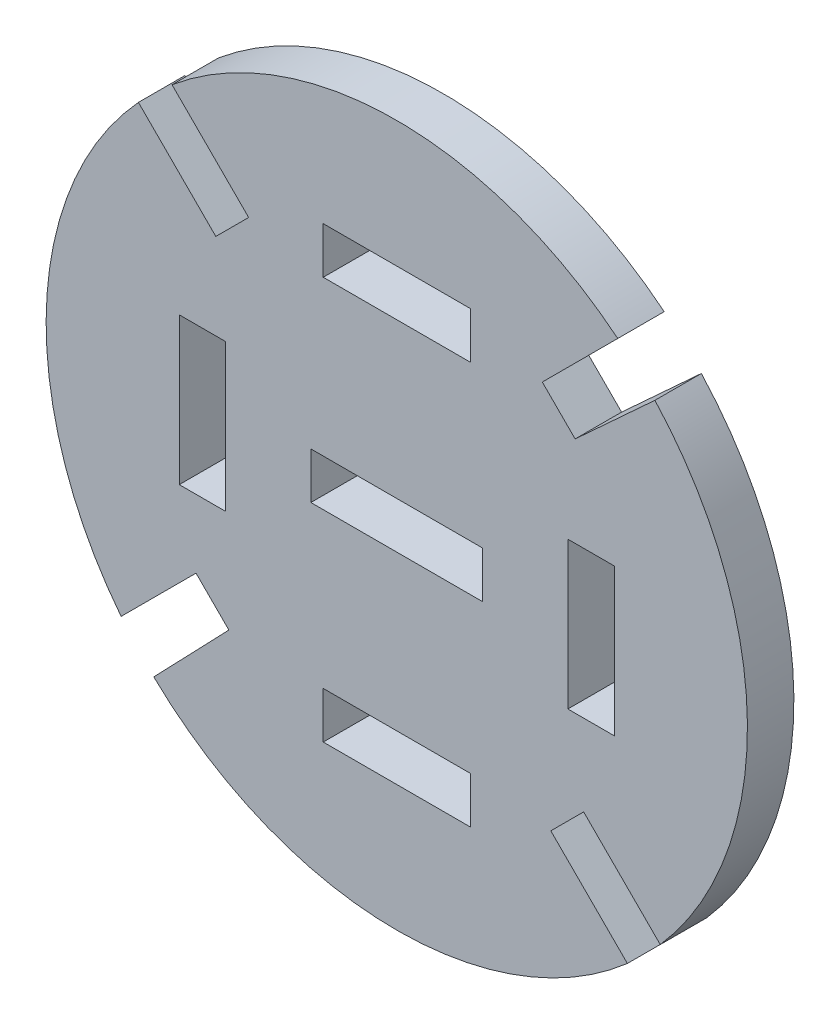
ISO-10303-21;
HEADER;
FILE_DESCRIPTION(('STEP AP214'),'2;1');
FILE_NAME('part.step','',(''),(''),'','','');
FILE_SCHEMA(('AUTOMOTIVE_DESIGN { 1 0 10303 214 1 1 1 1 }'));
ENDSEC;
DATA;
#1=APPLICATION_CONTEXT('core data for automotive mechanical design processes');
#2=APPLICATION_PROTOCOL_DEFINITION('international standard','automotive_design',2000,#1);
#3=PRODUCT_CONTEXT('',#1,'mechanical');
#4=PRODUCT('Part','Part','',(#3));
#5=PRODUCT_RELATED_PRODUCT_CATEGORY('part','',(#4));
#6=PRODUCT_DEFINITION_FORMATION('','',#4);
#7=PRODUCT_DEFINITION_CONTEXT('part definition',#1,'design');
#8=PRODUCT_DEFINITION('design','',#6,#7);
#9=PRODUCT_DEFINITION_SHAPE('','',#8);
#10=(LENGTH_UNIT() NAMED_UNIT(*) SI_UNIT(.MILLI.,.METRE.));
#11=(NAMED_UNIT(*) PLANE_ANGLE_UNIT() SI_UNIT($,.RADIAN.));
#12=(NAMED_UNIT(*) SI_UNIT($,.STERADIAN.) SOLID_ANGLE_UNIT());
#13=UNCERTAINTY_MEASURE_WITH_UNIT(LENGTH_MEASURE(1.E-05),#10,'distance_accuracy_value','');
#14=(GEOMETRIC_REPRESENTATION_CONTEXT(3) GLOBAL_UNCERTAINTY_ASSIGNED_CONTEXT((#13)) GLOBAL_UNIT_ASSIGNED_CONTEXT((#10,
#11,#12)) REPRESENTATION_CONTEXT('',''));
#15=CARTESIAN_POINT('',(0.,0.,0.));
#16=DIRECTION('',(0.,0.,1.));
#17=DIRECTION('',(1.,0.,0.));
#18=AXIS2_PLACEMENT_3D('',#15,#16,#17);
#19=CARTESIAN_POINT('',(0.,0.,3.));
#20=DIRECTION('',(0.,0.,1.));
#21=DIRECTION('',(1.,0.,0.));
#22=AXIS2_PLACEMENT_3D('',#19,#20,#21);
#23=PLANE('',#22);
#24=CARTESIAN_POINT('',(0.,0.,3.));
#25=DIRECTION('',(0.,0.,1.));
#26=DIRECTION('',(1.,0.,0.));
#27=AXIS2_PLACEMENT_3D('',#24,#25,#26);
#28=CIRCLE('',#27,22.65);
#29=CARTESIAN_POINT('',(14.2729923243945,17.5870460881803,3.));
#30=VERTEX_POINT('',#29);
#31=CARTESIAN_POINT('',(-14.5176838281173,17.385607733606,3.));
#32=VERTEX_POINT('',#31);
#33=EDGE_CURVE('E497',#30,#32,#28,.T.);
#34=ORIENTED_EDGE('',*,*,#33,.T.);
#35=DIRECTION('',(0.707106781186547,-0.707106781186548,0.));
#36=VECTOR('',#35,1.);
#37=CARTESIAN_POINT('',(-9.56793635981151,12.4358602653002,3.));
#38=LINE('',#37,#36);
#39=CARTESIAN_POINT('',(-9.56793635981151,12.4358602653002,3.));
#40=VERTEX_POINT('',#39);
#41=EDGE_CURVE('E501',#32,#40,#38,.T.);
#42=ORIENTED_EDGE('',*,*,#41,.T.);
#43=DIRECTION('',(-0.707106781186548,-0.707106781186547,0.));
#44=VECTOR('',#43,1.);
#45=CARTESIAN_POINT('',(-11.6892567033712,10.3145399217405,3.));
#46=LINE('',#45,#44);
#47=CARTESIAN_POINT('',(-11.6892567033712,10.3145399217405,3.));
#48=VERTEX_POINT('',#47);
#49=EDGE_CURVE('E505',#40,#48,#46,.T.);
#50=ORIENTED_EDGE('',*,*,#49,.T.);
#51=DIRECTION('',(-0.707106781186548,0.707106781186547,0.));
#52=VECTOR('',#51,1.);
#53=CARTESIAN_POINT('',(-11.6892567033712,10.3145399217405,3.));
#54=LINE('',#53,#52);
#55=CARTESIAN_POINT('',(-16.6885704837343,15.3138537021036,3.));
#56=VERTEX_POINT('',#55);
#57=EDGE_CURVE('E508',#48,#56,#54,.T.);
#58=ORIENTED_EDGE('',*,*,#57,.T.);
#59=CARTESIAN_POINT('',(0.,0.,3.));
#60=DIRECTION('',(0.,0.,1.));
#61=DIRECTION('',(1.,0.,0.));
#62=AXIS2_PLACEMENT_3D('',#59,#60,#61);
#63=CIRCLE('',#62,22.65);
#64=CARTESIAN_POINT('',(-17.8057155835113,-13.9992497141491,3.));
#65=VERTEX_POINT('',#64);
#66=EDGE_CURVE('E511',#56,#65,#63,.T.);
#67=ORIENTED_EDGE('',*,*,#66,.T.);
#68=DIRECTION('',(0.707106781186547,0.707106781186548,0.));
#69=VECTOR('',#68,1.);
#70=CARTESIAN_POINT('',(-12.9673048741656,-9.16083900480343,3.));
#71=LINE('',#70,#69);
#72=CARTESIAN_POINT('',(-12.9673048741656,-9.16083900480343,3.));
#73=VERTEX_POINT('',#72);
#74=EDGE_CURVE('E514',#65,#73,#71,.T.);
#75=ORIENTED_EDGE('',*,*,#74,.T.);
#76=DIRECTION('',(0.707106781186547,-0.707106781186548,0.));
#77=VECTOR('',#76,1.);
#78=CARTESIAN_POINT('',(-10.845984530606,-11.2821593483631,3.));
#79=LINE('',#78,#77);
#80=CARTESIAN_POINT('',(-10.845984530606,-11.2821593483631,3.));
#81=VERTEX_POINT('',#80);
#82=EDGE_CURVE('E517',#73,#81,#79,.T.);
#83=ORIENTED_EDGE('',*,*,#82,.T.);
#84=DIRECTION('',(-0.693034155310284,-0.720904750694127,0.));
#85=VECTOR('',#84,1.);
#86=CARTESIAN_POINT('',(-10.845984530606,-11.2821593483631,3.));
#87=LINE('',#86,#85);
#88=CARTESIAN_POINT('',(-15.6972236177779,-16.328492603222,3.));
#89=VERTEX_POINT('',#88);
#90=EDGE_CURVE('E520',#81,#89,#87,.T.);
#91=ORIENTED_EDGE('',*,*,#90,.T.);
#92=CARTESIAN_POINT('',(0.,0.,3.));
#93=DIRECTION('',(0.,0.,1.));
#94=DIRECTION('',(1.,0.,0.));
#95=AXIS2_PLACEMENT_3D('',#92,#93,#94);
#96=CIRCLE('',#95,22.65);
#97=CARTESIAN_POINT('',(14.8951464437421,-17.0633265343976,3.));
#98=VERTEX_POINT('',#97);
#99=EDGE_CURVE('E523',#89,#98,#96,.T.);
#100=ORIENTED_EDGE('',*,*,#99,.T.);
#101=DIRECTION('',(-0.707106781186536,0.707106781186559,0.));
#102=VECTOR('',#101,1.);
#103=CARTESIAN_POINT('',(9.94850910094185,-12.1166891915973,3.));
#104=LINE('',#103,#102);
#105=CARTESIAN_POINT('',(9.94850910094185,-12.1166891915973,3.));
#106=VERTEX_POINT('',#105);
#107=EDGE_CURVE('E526',#98,#106,#104,.T.);
#108=ORIENTED_EDGE('',*,*,#107,.T.);
#109=DIRECTION('',(0.707106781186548,0.707106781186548,0.));
#110=VECTOR('',#109,1.);
#111=CARTESIAN_POINT('',(9.94850910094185,-12.1166891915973,3.));
#112=LINE('',#111,#110);
#113=CARTESIAN_POINT('',(12.0698294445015,-9.99536884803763,3.));
#114=VERTEX_POINT('',#113);
#115=EDGE_CURVE('E529',#106,#114,#112,.T.);
#116=ORIENTED_EDGE('',*,*,#115,.T.);
#117=DIRECTION('',(0.707106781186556,-0.707106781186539,0.));
#118=VECTOR('',#117,1.);
#119=CARTESIAN_POINT('',(12.0698294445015,-9.99536884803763,3.));
#120=LINE('',#119,#118);
#121=CARTESIAN_POINT('',(17.0195769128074,-14.9451163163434,3.));
#122=VERTEX_POINT('',#121);
#123=EDGE_CURVE('E532',#114,#122,#120,.T.);
#124=ORIENTED_EDGE('',*,*,#123,.T.);
#125=CARTESIAN_POINT('',(0.,0.,3.));
#126=DIRECTION('',(0.,0.,1.));
#127=DIRECTION('',(1.,0.,0.));
#128=AXIS2_PLACEMENT_3D('',#125,#126,#127);
#129=CIRCLE('',#128,22.65);
#130=CARTESIAN_POINT('',(16.6738305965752,15.3299012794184,3.));
#131=VERTEX_POINT('',#130);
#132=EDGE_CURVE('E535',#122,#131,#129,.T.);
#133=ORIENTED_EDGE('',*,*,#132,.T.);
#134=DIRECTION('',(-0.736151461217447,-0.676816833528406,0.));
#135=VECTOR('',#134,1.);
#136=CARTESIAN_POINT('',(11.520770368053,10.5921834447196,3.));
#137=LINE('',#136,#135);
#138=CARTESIAN_POINT('',(11.520770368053,10.5921834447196,3.));
#139=VERTEX_POINT('',#138);
#140=EDGE_CURVE('E538',#131,#139,#137,.T.);
#141=ORIENTED_EDGE('',*,*,#140,.T.);
#142=DIRECTION('',(-0.707106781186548,0.707106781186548,0.));
#143=VECTOR('',#142,1.);
#144=CARTESIAN_POINT('',(9.3994500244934,12.7135037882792,3.));
#145=LINE('',#144,#143);
#146=CARTESIAN_POINT('',(9.3994500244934,12.7135037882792,3.));
#147=VERTEX_POINT('',#146);
#148=EDGE_CURVE('E541',#139,#147,#145,.T.);
#149=ORIENTED_EDGE('',*,*,#148,.T.);
#150=DIRECTION('',(0.707106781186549,0.707106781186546,0.));
#151=VECTOR('',#150,1.);
#152=CARTESIAN_POINT('',(9.3994500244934,12.7135037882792,3.));
#153=LINE('',#152,#151);
#154=EDGE_CURVE('E544',#147,#30,#153,.T.);
#155=ORIENTED_EDGE('',*,*,#154,.T.);
#156=EDGE_LOOP('',(#34,#42,#50,#58,#67,#75,#83,#91,#100,#108,#116,#124,#133,#141,#149,#155));
#157=FACE_BOUND('',#156,.T.);
#158=DIRECTION('',(-1.,0.,0.));
#159=VECTOR('',#158,1.);
#160=CARTESIAN_POINT('',(-5.55,1.5,3.));
#161=LINE('',#160,#159);
#162=CARTESIAN_POINT('',(5.55,1.5,3.));
#163=VERTEX_POINT('',#162);
#164=CARTESIAN_POINT('',(-5.55,1.5,3.));
#165=VERTEX_POINT('',#164);
#166=EDGE_CURVE('E457',#163,#165,#161,.T.);
#167=ORIENTED_EDGE('',*,*,#166,.F.);
#168=DIRECTION('',(0.,1.,0.));
#169=VECTOR('',#168,1.);
#170=CARTESIAN_POINT('',(5.55,1.5,3.));
#171=LINE('',#170,#169);
#172=CARTESIAN_POINT('',(5.55,-1.5,3.));
#173=VERTEX_POINT('',#172);
#174=EDGE_CURVE('E454',#173,#163,#171,.T.);
#175=ORIENTED_EDGE('',*,*,#174,.F.);
#176=DIRECTION('',(1.,0.,0.));
#177=VECTOR('',#176,1.);
#178=CARTESIAN_POINT('',(-5.55,-1.5,3.));
#179=LINE('',#178,#177);
#180=CARTESIAN_POINT('',(-5.55,-1.5,3.));
#181=VERTEX_POINT('',#180);
#182=EDGE_CURVE('E465',#181,#173,#179,.T.);
#183=ORIENTED_EDGE('',*,*,#182,.F.);
#184=DIRECTION('',(0.,-1.,0.));
#185=VECTOR('',#184,1.);
#186=CARTESIAN_POINT('',(-5.55,1.5,3.));
#187=LINE('',#186,#185);
#188=EDGE_CURVE('E461',#165,#181,#187,.T.);
#189=ORIENTED_EDGE('',*,*,#188,.F.);
#190=EDGE_LOOP('',(#167,#175,#183,#189));
#191=FACE_BOUND('',#190,.T.);
#192=DIRECTION('',(-1.,0.,0.));
#193=VECTOR('',#192,1.);
#194=CARTESIAN_POINT('',(-4.75,-11.5,3.));
#195=LINE('',#194,#193);
#196=CARTESIAN_POINT('',(4.75,-11.5,3.));
#197=VERTEX_POINT('',#196);
#198=CARTESIAN_POINT('',(-4.75,-11.5,3.));
#199=VERTEX_POINT('',#198);
#200=EDGE_CURVE('E414',#197,#199,#195,.T.);
#201=ORIENTED_EDGE('',*,*,#200,.F.);
#202=DIRECTION('',(0.,1.,0.));
#203=VECTOR('',#202,1.);
#204=CARTESIAN_POINT('',(4.75,-11.5,3.));
#205=LINE('',#204,#203);
#206=CARTESIAN_POINT('',(4.75,-14.5,3.));
#207=VERTEX_POINT('',#206);
#208=EDGE_CURVE('E411',#207,#197,#205,.T.);
#209=ORIENTED_EDGE('',*,*,#208,.F.);
#210=DIRECTION('',(1.,0.,0.));
#211=VECTOR('',#210,1.);
#212=CARTESIAN_POINT('',(-4.75,-14.5,3.));
#213=LINE('',#212,#211);
#214=CARTESIAN_POINT('',(-4.75,-14.5,3.));
#215=VERTEX_POINT('',#214);
#216=EDGE_CURVE('E422',#215,#207,#213,.T.);
#217=ORIENTED_EDGE('',*,*,#216,.F.);
#218=DIRECTION('',(0.,-1.,0.));
#219=VECTOR('',#218,1.);
#220=CARTESIAN_POINT('',(-4.75,-11.5,3.));
#221=LINE('',#220,#219);
#222=EDGE_CURVE('E418',#199,#215,#221,.T.);
#223=ORIENTED_EDGE('',*,*,#222,.F.);
#224=EDGE_LOOP('',(#201,#209,#217,#223));
#225=FACE_BOUND('',#224,.T.);
#226=DIRECTION('',(1.,0.,0.));
#227=VECTOR('',#226,1.);
#228=CARTESIAN_POINT('',(11.05,-4.75,3.));
#229=LINE('',#228,#227);
#230=CARTESIAN_POINT('',(11.05,-4.75,3.));
#231=VERTEX_POINT('',#230);
#232=CARTESIAN_POINT('',(14.05,-4.75,3.));
#233=VERTEX_POINT('',#232);
#234=EDGE_CURVE('E371',#231,#233,#229,.T.);
#235=ORIENTED_EDGE('',*,*,#234,.F.);
#236=DIRECTION('',(0.,-1.,0.));
#237=VECTOR('',#236,1.);
#238=CARTESIAN_POINT('',(11.05,4.75,3.));
#239=LINE('',#238,#237);
#240=CARTESIAN_POINT('',(11.05,4.75,3.));
#241=VERTEX_POINT('',#240);
#242=EDGE_CURVE('E368',#241,#231,#239,.T.);
#243=ORIENTED_EDGE('',*,*,#242,.F.);
#244=DIRECTION('',(-1.,0.,0.));
#245=VECTOR('',#244,1.);
#246=CARTESIAN_POINT('',(11.05,4.75,3.));
#247=LINE('',#246,#245);
#248=CARTESIAN_POINT('',(14.05,4.75,3.));
#249=VERTEX_POINT('',#248);
#250=EDGE_CURVE('E379',#249,#241,#247,.T.);
#251=ORIENTED_EDGE('',*,*,#250,.F.);
#252=DIRECTION('',(0.,1.,0.));
#253=VECTOR('',#252,1.);
#254=CARTESIAN_POINT('',(14.05,4.75,3.));
#255=LINE('',#254,#253);
#256=EDGE_CURVE('E375',#233,#249,#255,.T.);
#257=ORIENTED_EDGE('',*,*,#256,.F.);
#258=EDGE_LOOP('',(#235,#243,#251,#257));
#259=FACE_BOUND('',#258,.T.);
#260=DIRECTION('',(-1.,0.,0.));
#261=VECTOR('',#260,1.);
#262=CARTESIAN_POINT('',(-4.75,14.5,3.));
#263=LINE('',#262,#261);
#264=CARTESIAN_POINT('',(4.75,14.5,3.));
#265=VERTEX_POINT('',#264);
#266=CARTESIAN_POINT('',(-4.75,14.5,3.));
#267=VERTEX_POINT('',#266);
#268=EDGE_CURVE('E328',#265,#267,#263,.T.);
#269=ORIENTED_EDGE('',*,*,#268,.F.);
#270=DIRECTION('',(0.,1.,0.));
#271=VECTOR('',#270,1.);
#272=CARTESIAN_POINT('',(4.75,11.5,3.));
#273=LINE('',#272,#271);
#274=CARTESIAN_POINT('',(4.75,11.5,3.));
#275=VERTEX_POINT('',#274);
#276=EDGE_CURVE('E325',#275,#265,#273,.T.);
#277=ORIENTED_EDGE('',*,*,#276,.F.);
#278=DIRECTION('',(1.,0.,0.));
#279=VECTOR('',#278,1.);
#280=CARTESIAN_POINT('',(-4.75,11.5,3.));
#281=LINE('',#280,#279);
#282=CARTESIAN_POINT('',(-4.75,11.5,3.));
#283=VERTEX_POINT('',#282);
#284=EDGE_CURVE('E336',#283,#275,#281,.T.);
#285=ORIENTED_EDGE('',*,*,#284,.F.);
#286=DIRECTION('',(0.,-1.,0.));
#287=VECTOR('',#286,1.);
#288=CARTESIAN_POINT('',(-4.75,11.5,3.));
#289=LINE('',#288,#287);
#290=EDGE_CURVE('E332',#267,#283,#289,.T.);
#291=ORIENTED_EDGE('',*,*,#290,.F.);
#292=EDGE_LOOP('',(#269,#277,#285,#291));
#293=FACE_BOUND('',#292,.T.);
#294=DIRECTION('',(-1.,0.,0.));
#295=VECTOR('',#294,1.);
#296=CARTESIAN_POINT('',(-14.05,4.75,3.));
#297=LINE('',#296,#295);
#298=CARTESIAN_POINT('',(-11.05,4.75,3.));
#299=VERTEX_POINT('',#298);
#300=CARTESIAN_POINT('',(-14.05,4.75,3.));
#301=VERTEX_POINT('',#300);
#302=EDGE_CURVE('E286',#299,#301,#297,.T.);
#303=ORIENTED_EDGE('',*,*,#302,.F.);
#304=DIRECTION('',(0.,1.,0.));
#305=VECTOR('',#304,1.);
#306=CARTESIAN_POINT('',(-11.05,-4.75,3.));
#307=LINE('',#306,#305);
#308=CARTESIAN_POINT('',(-11.05,-4.75,3.));
#309=VERTEX_POINT('',#308);
#310=EDGE_CURVE('E277',#309,#299,#307,.T.);
#311=ORIENTED_EDGE('',*,*,#310,.F.);
#312=DIRECTION('',(1.,0.,0.));
#313=VECTOR('',#312,1.);
#314=CARTESIAN_POINT('',(-14.05,-4.75,3.));
#315=LINE('',#314,#313);
#316=CARTESIAN_POINT('',(-14.05,-4.75,3.));
#317=VERTEX_POINT('',#316);
#318=EDGE_CURVE('E303',#317,#309,#315,.T.);
#319=ORIENTED_EDGE('',*,*,#318,.F.);
#320=DIRECTION('',(0.,-1.,0.));
#321=VECTOR('',#320,1.);
#322=CARTESIAN_POINT('',(-14.05,-4.75,3.));
#323=LINE('',#322,#321);
#324=EDGE_CURVE('E299',#301,#317,#323,.T.);
#325=ORIENTED_EDGE('',*,*,#324,.F.);
#326=EDGE_LOOP('',(#303,#311,#319,#325));
#327=FACE_BOUND('',#326,.T.);
#328=ADVANCED_FACE('F43',(#157,#191,#225,#259,#293,#327),#23,.T.);
#329=CARTESIAN_POINT('',(0.,0.,0.));
#330=DIRECTION('',(0.,0.,1.));
#331=DIRECTION('',(1.,0.,0.));
#332=AXIS2_PLACEMENT_3D('',#329,#330,#331);
#333=PLANE('',#332);
#334=DIRECTION('',(0.,1.,0.));
#335=VECTOR('',#334,1.);
#336=CARTESIAN_POINT('',(4.75,11.5,0.));
#337=LINE('',#336,#335);
#338=CARTESIAN_POINT('',(4.75,11.5,0.));
#339=VERTEX_POINT('',#338);
#340=CARTESIAN_POINT('',(4.75,14.5,0.));
#341=VERTEX_POINT('',#340);
#342=EDGE_CURVE('E295',#339,#341,#337,.T.);
#343=ORIENTED_EDGE('',*,*,#342,.T.);
#344=DIRECTION('',(-1.,0.,0.));
#345=VECTOR('',#344,1.);
#346=CARTESIAN_POINT('',(-4.75,14.5,0.));
#347=LINE('',#346,#345);
#348=CARTESIAN_POINT('',(-4.75,14.5,0.));
#349=VERTEX_POINT('',#348);
#350=EDGE_CURVE('E343',#341,#349,#347,.T.);
#351=ORIENTED_EDGE('',*,*,#350,.T.);
#352=DIRECTION('',(0.,-1.,0.));
#353=VECTOR('',#352,1.);
#354=CARTESIAN_POINT('',(-4.75,11.5,0.));
#355=LINE('',#354,#353);
#356=CARTESIAN_POINT('',(-4.75,11.5,0.));
#357=VERTEX_POINT('',#356);
#358=EDGE_CURVE('E347',#349,#357,#355,.T.);
#359=ORIENTED_EDGE('',*,*,#358,.T.);
#360=DIRECTION('',(1.,0.,0.));
#361=VECTOR('',#360,1.);
#362=CARTESIAN_POINT('',(-4.75,11.5,0.));
#363=LINE('',#362,#361);
#364=EDGE_CURVE('E329',#357,#339,#363,.T.);
#365=ORIENTED_EDGE('',*,*,#364,.T.);
#366=EDGE_LOOP('',(#343,#351,#359,#365));
#367=FACE_BOUND('',#366,.T.);
#368=DIRECTION('',(0.,1.,0.));
#369=VECTOR('',#368,1.);
#370=CARTESIAN_POINT('',(4.75,-11.5,0.));
#371=LINE('',#370,#369);
#372=CARTESIAN_POINT('',(4.75,-14.5,0.));
#373=VERTEX_POINT('',#372);
#374=CARTESIAN_POINT('',(4.75,-11.5,0.));
#375=VERTEX_POINT('',#374);
#376=EDGE_CURVE('E410',#373,#375,#371,.T.);
#377=ORIENTED_EDGE('',*,*,#376,.T.);
#378=DIRECTION('',(-1.,0.,0.));
#379=VECTOR('',#378,1.);
#380=CARTESIAN_POINT('',(-4.75,-11.5,0.));
#381=LINE('',#380,#379);
#382=CARTESIAN_POINT('',(-4.75,-11.5,0.));
#383=VERTEX_POINT('',#382);
#384=EDGE_CURVE('E429',#375,#383,#381,.T.);
#385=ORIENTED_EDGE('',*,*,#384,.T.);
#386=DIRECTION('',(0.,-1.,0.));
#387=VECTOR('',#386,1.);
#388=CARTESIAN_POINT('',(-4.75,-11.5,0.));
#389=LINE('',#388,#387);
#390=CARTESIAN_POINT('',(-4.75,-14.5,0.));
#391=VERTEX_POINT('',#390);
#392=EDGE_CURVE('E433',#383,#391,#389,.T.);
#393=ORIENTED_EDGE('',*,*,#392,.T.);
#394=DIRECTION('',(1.,0.,0.));
#395=VECTOR('',#394,1.);
#396=CARTESIAN_POINT('',(-4.75,-14.5,0.));
#397=LINE('',#396,#395);
#398=EDGE_CURVE('E415',#391,#373,#397,.T.);
#399=ORIENTED_EDGE('',*,*,#398,.T.);
#400=EDGE_LOOP('',(#377,#385,#393,#399));
#401=FACE_BOUND('',#400,.T.);
#402=CARTESIAN_POINT('',(0.,0.,0.));
#403=DIRECTION('',(0.,0.,1.));
#404=DIRECTION('',(1.,0.,0.));
#405=AXIS2_PLACEMENT_3D('',#402,#403,#404);
#406=CIRCLE('',#405,22.65);
#407=CARTESIAN_POINT('',(14.2729923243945,17.5870460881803,0.));
#408=VERTEX_POINT('',#407);
#409=CARTESIAN_POINT('',(-14.5176838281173,17.385607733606,0.));
#410=VERTEX_POINT('',#409);
#411=EDGE_CURVE('E496',#408,#410,#406,.T.);
#412=ORIENTED_EDGE('',*,*,#411,.F.);
#413=DIRECTION('',(0.707106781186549,0.707106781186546,0.));
#414=VECTOR('',#413,1.);
#415=CARTESIAN_POINT('',(9.3994500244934,12.7135037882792,0.));
#416=LINE('',#415,#414);
#417=CARTESIAN_POINT('',(9.3994500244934,12.7135037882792,0.));
#418=VERTEX_POINT('',#417);
#419=EDGE_CURVE('E502',#418,#408,#416,.T.);
#420=ORIENTED_EDGE('',*,*,#419,.F.);
#421=DIRECTION('',(-0.707106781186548,0.707106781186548,0.));
#422=VECTOR('',#421,1.);
#423=CARTESIAN_POINT('',(9.3994500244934,12.7135037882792,0.));
#424=LINE('',#423,#422);
#425=CARTESIAN_POINT('',(11.520770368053,10.5921834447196,0.));
#426=VERTEX_POINT('',#425);
#427=EDGE_CURVE('E590',#426,#418,#424,.T.);
#428=ORIENTED_EDGE('',*,*,#427,.F.);
#429=DIRECTION('',(-0.736151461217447,-0.676816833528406,0.));
#430=VECTOR('',#429,1.);
#431=CARTESIAN_POINT('',(11.520770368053,10.5921834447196,0.));
#432=LINE('',#431,#430);
#433=CARTESIAN_POINT('',(16.6738305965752,15.3299012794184,0.));
#434=VERTEX_POINT('',#433);
#435=EDGE_CURVE('E587',#434,#426,#432,.T.);
#436=ORIENTED_EDGE('',*,*,#435,.F.);
#437=CARTESIAN_POINT('',(0.,0.,0.));
#438=DIRECTION('',(0.,0.,1.));
#439=DIRECTION('',(1.,0.,0.));
#440=AXIS2_PLACEMENT_3D('',#437,#438,#439);
#441=CIRCLE('',#440,22.65);
#442=CARTESIAN_POINT('',(17.0195769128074,-14.9451163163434,0.));
#443=VERTEX_POINT('',#442);
#444=EDGE_CURVE('E584',#443,#434,#441,.T.);
#445=ORIENTED_EDGE('',*,*,#444,.F.);
#446=DIRECTION('',(0.707106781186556,-0.707106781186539,0.));
#447=VECTOR('',#446,1.);
#448=CARTESIAN_POINT('',(12.0698294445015,-9.99536884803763,0.));
#449=LINE('',#448,#447);
#450=CARTESIAN_POINT('',(12.0698294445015,-9.99536884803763,0.));
#451=VERTEX_POINT('',#450);
#452=EDGE_CURVE('E581',#451,#443,#449,.T.);
#453=ORIENTED_EDGE('',*,*,#452,.F.);
#454=DIRECTION('',(0.707106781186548,0.707106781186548,0.));
#455=VECTOR('',#454,1.);
#456=CARTESIAN_POINT('',(9.94850910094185,-12.1166891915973,0.));
#457=LINE('',#456,#455);
#458=CARTESIAN_POINT('',(9.94850910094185,-12.1166891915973,0.));
#459=VERTEX_POINT('',#458);
#460=EDGE_CURVE('E578',#459,#451,#457,.T.);
#461=ORIENTED_EDGE('',*,*,#460,.F.);
#462=DIRECTION('',(-0.707106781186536,0.707106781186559,0.));
#463=VECTOR('',#462,1.);
#464=CARTESIAN_POINT('',(9.94850910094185,-12.1166891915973,0.));
#465=LINE('',#464,#463);
#466=CARTESIAN_POINT('',(14.8951464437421,-17.0633265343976,0.));
#467=VERTEX_POINT('',#466);
#468=EDGE_CURVE('E575',#467,#459,#465,.T.);
#469=ORIENTED_EDGE('',*,*,#468,.F.);
#470=CARTESIAN_POINT('',(0.,0.,0.));
#471=DIRECTION('',(0.,0.,1.));
#472=DIRECTION('',(1.,0.,0.));
#473=AXIS2_PLACEMENT_3D('',#470,#471,#472);
#474=CIRCLE('',#473,22.65);
#475=CARTESIAN_POINT('',(-15.6972236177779,-16.328492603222,0.));
#476=VERTEX_POINT('',#475);
#477=EDGE_CURVE('E572',#476,#467,#474,.T.);
#478=ORIENTED_EDGE('',*,*,#477,.F.);
#479=DIRECTION('',(-0.693034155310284,-0.720904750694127,0.));
#480=VECTOR('',#479,1.);
#481=CARTESIAN_POINT('',(-10.845984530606,-11.2821593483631,0.));
#482=LINE('',#481,#480);
#483=CARTESIAN_POINT('',(-10.845984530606,-11.2821593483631,0.));
#484=VERTEX_POINT('',#483);
#485=EDGE_CURVE('E569',#484,#476,#482,.T.);
#486=ORIENTED_EDGE('',*,*,#485,.F.);
#487=DIRECTION('',(0.707106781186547,-0.707106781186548,0.));
#488=VECTOR('',#487,1.);
#489=CARTESIAN_POINT('',(-10.845984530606,-11.2821593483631,0.));
#490=LINE('',#489,#488);
#491=CARTESIAN_POINT('',(-12.9673048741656,-9.16083900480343,0.));
#492=VERTEX_POINT('',#491);
#493=EDGE_CURVE('E566',#492,#484,#490,.T.);
#494=ORIENTED_EDGE('',*,*,#493,.F.);
#495=DIRECTION('',(0.707106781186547,0.707106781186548,0.));
#496=VECTOR('',#495,1.);
#497=CARTESIAN_POINT('',(-12.9673048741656,-9.16083900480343,0.));
#498=LINE('',#497,#496);
#499=CARTESIAN_POINT('',(-17.8057155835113,-13.9992497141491,0.));
#500=VERTEX_POINT('',#499);
#501=EDGE_CURVE('E563',#500,#492,#498,.T.);
#502=ORIENTED_EDGE('',*,*,#501,.F.);
#503=CARTESIAN_POINT('',(0.,0.,0.));
#504=DIRECTION('',(0.,0.,1.));
#505=DIRECTION('',(1.,0.,0.));
#506=AXIS2_PLACEMENT_3D('',#503,#504,#505);
#507=CIRCLE('',#506,22.65);
#508=CARTESIAN_POINT('',(-16.6885704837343,15.3138537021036,0.));
#509=VERTEX_POINT('',#508);
#510=EDGE_CURVE('E560',#509,#500,#507,.T.);
#511=ORIENTED_EDGE('',*,*,#510,.F.);
#512=DIRECTION('',(-0.707106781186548,0.707106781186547,0.));
#513=VECTOR('',#512,1.);
#514=CARTESIAN_POINT('',(-11.6892567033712,10.3145399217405,0.));
#515=LINE('',#514,#513);
#516=CARTESIAN_POINT('',(-11.6892567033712,10.3145399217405,0.));
#517=VERTEX_POINT('',#516);
#518=EDGE_CURVE('E557',#517,#509,#515,.T.);
#519=ORIENTED_EDGE('',*,*,#518,.F.);
#520=DIRECTION('',(-0.707106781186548,-0.707106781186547,0.));
#521=VECTOR('',#520,1.);
#522=CARTESIAN_POINT('',(-11.6892567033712,10.3145399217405,0.));
#523=LINE('',#522,#521);
#524=CARTESIAN_POINT('',(-9.56793635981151,12.4358602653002,0.));
#525=VERTEX_POINT('',#524);
#526=EDGE_CURVE('E554',#525,#517,#523,.T.);
#527=ORIENTED_EDGE('',*,*,#526,.F.);
#528=DIRECTION('',(0.707106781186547,-0.707106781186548,0.));
#529=VECTOR('',#528,1.);
#530=CARTESIAN_POINT('',(-9.56793635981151,12.4358602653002,0.));
#531=LINE('',#530,#529);
#532=EDGE_CURVE('E551',#410,#525,#531,.T.);
#533=ORIENTED_EDGE('',*,*,#532,.F.);
#534=EDGE_LOOP('',(#412,#420,#428,#436,#445,#453,#461,#469,#478,#486,#494,#502,#511,#519,#527,#533));
#535=FACE_BOUND('',#534,.T.);
#536=DIRECTION('',(0.,1.,0.));
#537=VECTOR('',#536,1.);
#538=CARTESIAN_POINT('',(5.55,1.5,0.));
#539=LINE('',#538,#537);
#540=CARTESIAN_POINT('',(5.55,-1.5,0.));
#541=VERTEX_POINT('',#540);
#542=CARTESIAN_POINT('',(5.55,1.5,0.));
#543=VERTEX_POINT('',#542);
#544=EDGE_CURVE('E453',#541,#543,#539,.T.);
#545=ORIENTED_EDGE('',*,*,#544,.T.);
#546=DIRECTION('',(-1.,0.,0.));
#547=VECTOR('',#546,1.);
#548=CARTESIAN_POINT('',(-5.55,1.5,0.));
#549=LINE('',#548,#547);
#550=CARTESIAN_POINT('',(-5.55,1.5,0.));
#551=VERTEX_POINT('',#550);
#552=EDGE_CURVE('E472',#543,#551,#549,.T.);
#553=ORIENTED_EDGE('',*,*,#552,.T.);
#554=DIRECTION('',(0.,-1.,0.));
#555=VECTOR('',#554,1.);
#556=CARTESIAN_POINT('',(-5.55,1.5,0.));
#557=LINE('',#556,#555);
#558=CARTESIAN_POINT('',(-5.55,-1.5,0.));
#559=VERTEX_POINT('',#558);
#560=EDGE_CURVE('E476',#551,#559,#557,.T.);
#561=ORIENTED_EDGE('',*,*,#560,.T.);
#562=DIRECTION('',(1.,0.,0.));
#563=VECTOR('',#562,1.);
#564=CARTESIAN_POINT('',(-5.55,-1.5,0.));
#565=LINE('',#564,#563);
#566=EDGE_CURVE('E458',#559,#541,#565,.T.);
#567=ORIENTED_EDGE('',*,*,#566,.T.);
#568=EDGE_LOOP('',(#545,#553,#561,#567));
#569=FACE_BOUND('',#568,.T.);
#570=DIRECTION('',(0.,-1.,0.));
#571=VECTOR('',#570,1.);
#572=CARTESIAN_POINT('',(11.05,4.75,0.));
#573=LINE('',#572,#571);
#574=CARTESIAN_POINT('',(11.05,4.75,0.));
#575=VERTEX_POINT('',#574);
#576=CARTESIAN_POINT('',(11.05,-4.75,0.));
#577=VERTEX_POINT('',#576);
#578=EDGE_CURVE('E367',#575,#577,#573,.T.);
#579=ORIENTED_EDGE('',*,*,#578,.T.);
#580=DIRECTION('',(1.,0.,0.));
#581=VECTOR('',#580,1.);
#582=CARTESIAN_POINT('',(11.05,-4.75,0.));
#583=LINE('',#582,#581);
#584=CARTESIAN_POINT('',(14.05,-4.75,0.));
#585=VERTEX_POINT('',#584);
#586=EDGE_CURVE('E386',#577,#585,#583,.T.);
#587=ORIENTED_EDGE('',*,*,#586,.T.);
#588=DIRECTION('',(0.,1.,0.));
#589=VECTOR('',#588,1.);
#590=CARTESIAN_POINT('',(14.05,4.75,0.));
#591=LINE('',#590,#589);
#592=CARTESIAN_POINT('',(14.05,4.75,0.));
#593=VERTEX_POINT('',#592);
#594=EDGE_CURVE('E390',#585,#593,#591,.T.);
#595=ORIENTED_EDGE('',*,*,#594,.T.);
#596=DIRECTION('',(-1.,0.,0.));
#597=VECTOR('',#596,1.);
#598=CARTESIAN_POINT('',(11.05,4.75,0.));
#599=LINE('',#598,#597);
#600=EDGE_CURVE('E372',#593,#575,#599,.T.);
#601=ORIENTED_EDGE('',*,*,#600,.T.);
#602=EDGE_LOOP('',(#579,#587,#595,#601));
#603=FACE_BOUND('',#602,.T.);
#604=DIRECTION('',(0.,1.,0.));
#605=VECTOR('',#604,1.);
#606=CARTESIAN_POINT('',(-11.05,-4.75,0.));
#607=LINE('',#606,#605);
#608=CARTESIAN_POINT('',(-11.05,-4.75,0.));
#609=VERTEX_POINT('',#608);
#610=CARTESIAN_POINT('',(-11.05,4.75,0.));
#611=VERTEX_POINT('',#610);
#612=EDGE_CURVE('E67',#609,#611,#607,.T.);
#613=ORIENTED_EDGE('',*,*,#612,.T.);
#614=DIRECTION('',(-1.,0.,0.));
#615=VECTOR('',#614,1.);
#616=CARTESIAN_POINT('',(-14.05,4.75,0.));
#617=LINE('',#616,#615);
#618=CARTESIAN_POINT('',(-14.05,4.75,0.));
#619=VERTEX_POINT('',#618);
#620=EDGE_CURVE('E293',#611,#619,#617,.T.);
#621=ORIENTED_EDGE('',*,*,#620,.T.);
#622=DIRECTION('',(0.,-1.,0.));
#623=VECTOR('',#622,1.);
#624=CARTESIAN_POINT('',(-14.05,-4.75,0.));
#625=LINE('',#624,#623);
#626=CARTESIAN_POINT('',(-14.05,-4.75,0.));
#627=VERTEX_POINT('',#626);
#628=EDGE_CURVE('E312',#619,#627,#625,.T.);
#629=ORIENTED_EDGE('',*,*,#628,.T.);
#630=DIRECTION('',(1.,0.,0.));
#631=VECTOR('',#630,1.);
#632=CARTESIAN_POINT('',(-14.05,-4.75,0.));
#633=LINE('',#632,#631);
#634=EDGE_CURVE('E287',#627,#609,#633,.T.);
#635=ORIENTED_EDGE('',*,*,#634,.T.);
#636=EDGE_LOOP('',(#613,#621,#629,#635));
#637=FACE_BOUND('',#636,.T.);
#638=ADVANCED_FACE('F661',(#367,#401,#535,#569,#603,#637),#333,.F.);
#639=CARTESIAN_POINT('',(0.,0.,3.));
#640=DIRECTION('',(0.,0.,-1.));
#641=DIRECTION('',(-1.,0.,0.));
#642=AXIS2_PLACEMENT_3D('',#639,#640,#641);
#643=CYLINDRICAL_SURFACE('',#642,22.65);
#644=ORIENTED_EDGE('',*,*,#411,.T.);
#645=DIRECTION('',(0.,0.,-1.));
#646=VECTOR('',#645,1.);
#647=CARTESIAN_POINT('',(-14.5176838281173,17.385607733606,3.));
#648=LINE('',#647,#646);
#649=EDGE_CURVE('E11',#32,#410,#648,.T.);
#650=ORIENTED_EDGE('',*,*,#649,.F.);
#651=ORIENTED_EDGE('',*,*,#33,.F.);
#652=DIRECTION('',(0.,0.,-1.));
#653=VECTOR('',#652,1.);
#654=CARTESIAN_POINT('',(14.2729923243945,17.5870460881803,3.));
#655=LINE('',#654,#653);
#656=EDGE_CURVE('E547',#30,#408,#655,.T.);
#657=ORIENTED_EDGE('',*,*,#656,.T.);
#658=EDGE_LOOP('',(#644,#650,#651,#657));
#659=FACE_BOUND('',#658,.T.);
#660=ADVANCED_FACE('F45',(#659),#643,.T.);
#661=CARTESIAN_POINT('',(-9.56793635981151,12.4358602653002,3.));
#662=DIRECTION('',(0.707106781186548,0.707106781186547,0.));
#663=DIRECTION('',(-0.707106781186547,0.707106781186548,0.));
#664=AXIS2_PLACEMENT_3D('',#661,#662,#663);
#665=PLANE('',#664);
#666=ORIENTED_EDGE('',*,*,#532,.T.);
#667=DIRECTION('',(0.,0.,-1.));
#668=VECTOR('',#667,1.);
#669=CARTESIAN_POINT('',(-9.56793635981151,12.4358602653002,3.));
#670=LINE('',#669,#668);
#671=EDGE_CURVE('E52',#40,#525,#670,.T.);
#672=ORIENTED_EDGE('',*,*,#671,.F.);
#673=ORIENTED_EDGE('',*,*,#41,.F.);
#674=ORIENTED_EDGE('',*,*,#649,.T.);
#675=EDGE_LOOP('',(#666,#672,#673,#674));
#676=FACE_BOUND('',#675,.T.);
#677=ADVANCED_FACE('F679',(#676),#665,.F.);
#678=CARTESIAN_POINT('',(-11.6892567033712,10.3145399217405,3.));
#679=DIRECTION('',(0.707106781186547,-0.707106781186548,0.));
#680=DIRECTION('',(0.707106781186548,0.707106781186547,0.));
#681=AXIS2_PLACEMENT_3D('',#678,#679,#680);
#682=PLANE('',#681);
#683=ORIENTED_EDGE('',*,*,#526,.T.);
#684=DIRECTION('',(0.,0.,-1.));
#685=VECTOR('',#684,1.);
#686=CARTESIAN_POINT('',(-11.6892567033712,10.3145399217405,3.));
#687=LINE('',#686,#685);
#688=EDGE_CURVE('E646',#48,#517,#687,.T.);
#689=ORIENTED_EDGE('',*,*,#688,.F.);
#690=ORIENTED_EDGE('',*,*,#49,.F.);
#691=ORIENTED_EDGE('',*,*,#671,.T.);
#692=EDGE_LOOP('',(#683,#689,#690,#691));
#693=FACE_BOUND('',#692,.T.);
#694=ADVANCED_FACE('F655',(#693),#682,.F.);
#695=CARTESIAN_POINT('',(-11.6892567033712,10.3145399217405,3.));
#696=DIRECTION('',(-0.707106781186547,-0.707106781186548,0.));
#697=DIRECTION('',(0.707106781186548,-0.707106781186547,0.));
#698=AXIS2_PLACEMENT_3D('',#695,#696,#697);
#699=PLANE('',#698);
#700=ORIENTED_EDGE('',*,*,#518,.T.);
#701=DIRECTION('',(0.,0.,-1.));
#702=VECTOR('',#701,1.);
#703=CARTESIAN_POINT('',(-16.6885704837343,15.3138537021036,3.));
#704=LINE('',#703,#702);
#705=EDGE_CURVE('E642',#56,#509,#704,.T.);
#706=ORIENTED_EDGE('',*,*,#705,.F.);
#707=ORIENTED_EDGE('',*,*,#57,.F.);
#708=ORIENTED_EDGE('',*,*,#688,.T.);
#709=EDGE_LOOP('',(#700,#706,#707,#708));
#710=FACE_BOUND('',#709,.T.);
#711=ADVANCED_FACE('F667',(#710),#699,.F.);
#712=CARTESIAN_POINT('',(0.,0.,3.));
#713=DIRECTION('',(0.,0.,-1.));
#714=DIRECTION('',(-1.,0.,0.));
#715=AXIS2_PLACEMENT_3D('',#712,#713,#714);
#716=CYLINDRICAL_SURFACE('',#715,22.65);
#717=ORIENTED_EDGE('',*,*,#510,.T.);
#718=DIRECTION('',(0.,0.,-1.));
#719=VECTOR('',#718,1.);
#720=CARTESIAN_POINT('',(-17.8057155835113,-13.9992497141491,3.));
#721=LINE('',#720,#719);
#722=EDGE_CURVE('E638',#65,#500,#721,.T.);
#723=ORIENTED_EDGE('',*,*,#722,.F.);
#724=ORIENTED_EDGE('',*,*,#66,.F.);
#725=ORIENTED_EDGE('',*,*,#705,.T.);
#726=EDGE_LOOP('',(#717,#723,#724,#725));
#727=FACE_BOUND('',#726,.T.);
#728=ADVANCED_FACE('F671',(#727),#716,.T.);
#729=CARTESIAN_POINT('',(-12.9673048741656,-9.16083900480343,3.));
#730=DIRECTION('',(-0.707106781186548,0.707106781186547,0.));
#731=DIRECTION('',(-0.707106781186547,-0.707106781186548,0.));
#732=AXIS2_PLACEMENT_3D('',#729,#730,#731);
#733=PLANE('',#732);
#734=ORIENTED_EDGE('',*,*,#501,.T.);
#735=DIRECTION('',(0.,0.,-1.));
#736=VECTOR('',#735,1.);
#737=CARTESIAN_POINT('',(-12.9673048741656,-9.16083900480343,3.));
#738=LINE('',#737,#736);
#739=EDGE_CURVE('E634',#73,#492,#738,.T.);
#740=ORIENTED_EDGE('',*,*,#739,.F.);
#741=ORIENTED_EDGE('',*,*,#74,.F.);
#742=ORIENTED_EDGE('',*,*,#722,.T.);
#743=EDGE_LOOP('',(#734,#740,#741,#742));
#744=FACE_BOUND('',#743,.T.);
#745=ADVANCED_FACE('F732',(#744),#733,.F.);
#746=CARTESIAN_POINT('',(-10.845984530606,-11.2821593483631,3.));
#747=DIRECTION('',(0.707106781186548,0.707106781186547,0.));
#748=DIRECTION('',(-0.707106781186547,0.707106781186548,0.));
#749=AXIS2_PLACEMENT_3D('',#746,#747,#748);
#750=PLANE('',#749);
#751=ORIENTED_EDGE('',*,*,#493,.T.);
#752=DIRECTION('',(0.,0.,-1.));
#753=VECTOR('',#752,1.);
#754=CARTESIAN_POINT('',(-10.845984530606,-11.2821593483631,3.));
#755=LINE('',#754,#753);
#756=EDGE_CURVE('E630',#81,#484,#755,.T.);
#757=ORIENTED_EDGE('',*,*,#756,.F.);
#758=ORIENTED_EDGE('',*,*,#82,.F.);
#759=ORIENTED_EDGE('',*,*,#739,.T.);
#760=EDGE_LOOP('',(#751,#757,#758,#759));
#761=FACE_BOUND('',#760,.T.);
#762=ADVANCED_FACE('F729',(#761),#750,.F.);
#763=CARTESIAN_POINT('',(-10.845984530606,-11.2821593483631,3.));
#764=DIRECTION('',(0.720904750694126,-0.693034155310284,0.));
#765=DIRECTION('',(0.693034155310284,0.720904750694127,0.));
#766=AXIS2_PLACEMENT_3D('',#763,#764,#765);
#767=PLANE('',#766);
#768=ORIENTED_EDGE('',*,*,#485,.T.);
#769=DIRECTION('',(0.,0.,-1.));
#770=VECTOR('',#769,1.);
#771=CARTESIAN_POINT('',(-15.6972236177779,-16.328492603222,3.));
#772=LINE('',#771,#770);
#773=EDGE_CURVE('E626',#89,#476,#772,.T.);
#774=ORIENTED_EDGE('',*,*,#773,.F.);
#775=ORIENTED_EDGE('',*,*,#90,.F.);
#776=ORIENTED_EDGE('',*,*,#756,.T.);
#777=EDGE_LOOP('',(#768,#774,#775,#776));
#778=FACE_BOUND('',#777,.T.);
#779=ADVANCED_FACE('F725',(#778),#767,.F.);
#780=CARTESIAN_POINT('',(0.,0.,3.));
#781=DIRECTION('',(0.,0.,-1.));
#782=DIRECTION('',(-1.,0.,0.));
#783=AXIS2_PLACEMENT_3D('',#780,#781,#782);
#784=CYLINDRICAL_SURFACE('',#783,22.65);
#785=ORIENTED_EDGE('',*,*,#477,.T.);
#786=DIRECTION('',(0.,0.,-1.));
#787=VECTOR('',#786,1.);
#788=CARTESIAN_POINT('',(14.8951464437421,-17.0633265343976,3.));
#789=LINE('',#788,#787);
#790=EDGE_CURVE('E622',#98,#467,#789,.T.);
#791=ORIENTED_EDGE('',*,*,#790,.F.);
#792=ORIENTED_EDGE('',*,*,#99,.F.);
#793=ORIENTED_EDGE('',*,*,#773,.T.);
#794=EDGE_LOOP('',(#785,#791,#792,#793));
#795=FACE_BOUND('',#794,.T.);
#796=ADVANCED_FACE('F721',(#795),#784,.T.);
#797=CARTESIAN_POINT('',(9.94850910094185,-12.1166891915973,3.));
#798=DIRECTION('',(-0.707106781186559,-0.707106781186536,0.));
#799=DIRECTION('',(0.707106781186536,-0.707106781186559,0.));
#800=AXIS2_PLACEMENT_3D('',#797,#798,#799);
#801=PLANE('',#800);
#802=ORIENTED_EDGE('',*,*,#468,.T.);
#803=DIRECTION('',(0.,0.,-1.));
#804=VECTOR('',#803,1.);
#805=CARTESIAN_POINT('',(9.94850910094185,-12.1166891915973,3.));
#806=LINE('',#805,#804);
#807=EDGE_CURVE('E618',#106,#459,#806,.T.);
#808=ORIENTED_EDGE('',*,*,#807,.F.);
#809=ORIENTED_EDGE('',*,*,#107,.F.);
#810=ORIENTED_EDGE('',*,*,#790,.T.);
#811=EDGE_LOOP('',(#802,#808,#809,#810));
#812=FACE_BOUND('',#811,.T.);
#813=ADVANCED_FACE('F716',(#812),#801,.F.);
#814=CARTESIAN_POINT('',(9.94850910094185,-12.1166891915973,3.));
#815=DIRECTION('',(-0.707106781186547,0.707106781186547,0.));
#816=DIRECTION('',(-0.707106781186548,-0.707106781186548,0.));
#817=AXIS2_PLACEMENT_3D('',#814,#815,#816);
#818=PLANE('',#817);
#819=ORIENTED_EDGE('',*,*,#460,.T.);
#820=DIRECTION('',(0.,0.,-1.));
#821=VECTOR('',#820,1.);
#822=CARTESIAN_POINT('',(12.0698294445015,-9.99536884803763,3.));
#823=LINE('',#822,#821);
#824=EDGE_CURVE('E614',#114,#451,#823,.T.);
#825=ORIENTED_EDGE('',*,*,#824,.F.);
#826=ORIENTED_EDGE('',*,*,#115,.F.);
#827=ORIENTED_EDGE('',*,*,#807,.T.);
#828=EDGE_LOOP('',(#819,#825,#826,#827));
#829=FACE_BOUND('',#828,.T.);
#830=ADVANCED_FACE('F710',(#829),#818,.F.);
#831=CARTESIAN_POINT('',(12.0698294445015,-9.99536884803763,3.));
#832=DIRECTION('',(0.707106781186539,0.707106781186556,0.));
#833=DIRECTION('',(-0.707106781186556,0.707106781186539,0.));
#834=AXIS2_PLACEMENT_3D('',#831,#832,#833);
#835=PLANE('',#834);
#836=ORIENTED_EDGE('',*,*,#452,.T.);
#837=DIRECTION('',(0.,0.,-1.));
#838=VECTOR('',#837,1.);
#839=CARTESIAN_POINT('',(17.0195769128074,-14.9451163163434,3.));
#840=LINE('',#839,#838);
#841=EDGE_CURVE('E610',#122,#443,#840,.T.);
#842=ORIENTED_EDGE('',*,*,#841,.F.);
#843=ORIENTED_EDGE('',*,*,#123,.F.);
#844=ORIENTED_EDGE('',*,*,#824,.T.);
#845=EDGE_LOOP('',(#836,#842,#843,#844));
#846=FACE_BOUND('',#845,.T.);
#847=ADVANCED_FACE('F706',(#846),#835,.F.);
#848=CARTESIAN_POINT('',(0.,0.,3.));
#849=DIRECTION('',(0.,0.,-1.));
#850=DIRECTION('',(-1.,0.,0.));
#851=AXIS2_PLACEMENT_3D('',#848,#849,#850);
#852=CYLINDRICAL_SURFACE('',#851,22.65);
#853=ORIENTED_EDGE('',*,*,#444,.T.);
#854=DIRECTION('',(0.,0.,-1.));
#855=VECTOR('',#854,1.);
#856=CARTESIAN_POINT('',(16.6738305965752,15.3299012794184,3.));
#857=LINE('',#856,#855);
#858=EDGE_CURVE('E606',#131,#434,#857,.T.);
#859=ORIENTED_EDGE('',*,*,#858,.F.);
#860=ORIENTED_EDGE('',*,*,#132,.F.);
#861=ORIENTED_EDGE('',*,*,#841,.T.);
#862=EDGE_LOOP('',(#853,#859,#860,#861));
#863=FACE_BOUND('',#862,.T.);
#864=ADVANCED_FACE('F701',(#863),#852,.T.);
#865=CARTESIAN_POINT('',(11.520770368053,10.5921834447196,3.));
#866=DIRECTION('',(0.676816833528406,-0.736151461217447,0.));
#867=DIRECTION('',(0.736151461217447,0.676816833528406,0.));
#868=AXIS2_PLACEMENT_3D('',#865,#866,#867);
#869=PLANE('',#868);
#870=ORIENTED_EDGE('',*,*,#435,.T.);
#871=DIRECTION('',(0.,0.,-1.));
#872=VECTOR('',#871,1.);
#873=CARTESIAN_POINT('',(11.520770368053,10.5921834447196,3.));
#874=LINE('',#873,#872);
#875=EDGE_CURVE('E602',#139,#426,#874,.T.);
#876=ORIENTED_EDGE('',*,*,#875,.F.);
#877=ORIENTED_EDGE('',*,*,#140,.F.);
#878=ORIENTED_EDGE('',*,*,#858,.T.);
#879=EDGE_LOOP('',(#870,#876,#877,#878));
#880=FACE_BOUND('',#879,.T.);
#881=ADVANCED_FACE('F695',(#880),#869,.F.);
#882=CARTESIAN_POINT('',(9.3994500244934,12.7135037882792,3.));
#883=DIRECTION('',(-0.707106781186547,-0.707106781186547,0.));
#884=DIRECTION('',(0.707106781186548,-0.707106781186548,0.));
#885=AXIS2_PLACEMENT_3D('',#882,#883,#884);
#886=PLANE('',#885);
#887=ORIENTED_EDGE('',*,*,#427,.T.);
#888=DIRECTION('',(0.,0.,-1.));
#889=VECTOR('',#888,1.);
#890=CARTESIAN_POINT('',(9.3994500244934,12.7135037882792,3.));
#891=LINE('',#890,#889);
#892=EDGE_CURVE('E598',#147,#418,#891,.T.);
#893=ORIENTED_EDGE('',*,*,#892,.F.);
#894=ORIENTED_EDGE('',*,*,#148,.F.);
#895=ORIENTED_EDGE('',*,*,#875,.T.);
#896=EDGE_LOOP('',(#887,#893,#894,#895));
#897=FACE_BOUND('',#896,.T.);
#898=ADVANCED_FACE('F691',(#897),#886,.F.);
#899=CARTESIAN_POINT('',(9.3994500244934,12.7135037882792,3.));
#900=DIRECTION('',(-0.707106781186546,0.707106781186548,0.));
#901=DIRECTION('',(-0.707106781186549,-0.707106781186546,0.));
#902=AXIS2_PLACEMENT_3D('',#899,#900,#901);
#903=PLANE('',#902);
#904=ORIENTED_EDGE('',*,*,#419,.T.);
#905=ORIENTED_EDGE('',*,*,#656,.F.);
#906=ORIENTED_EDGE('',*,*,#154,.F.);
#907=ORIENTED_EDGE('',*,*,#892,.T.);
#908=EDGE_LOOP('',(#904,#905,#906,#907));
#909=FACE_BOUND('',#908,.T.);
#910=ADVANCED_FACE('F686',(#909),#903,.F.);
#911=CARTESIAN_POINT('',(5.55,1.5,3.));
#912=DIRECTION('',(-1.,0.,0.));
#913=DIRECTION('',(0.,-1.,0.));
#914=AXIS2_PLACEMENT_3D('',#911,#912,#913);
#915=PLANE('',#914);
#916=ORIENTED_EDGE('',*,*,#544,.F.);
#917=DIRECTION('',(0.,0.,-1.));
#918=VECTOR('',#917,1.);
#919=CARTESIAN_POINT('',(5.55,-1.5,3.));
#920=LINE('',#919,#918);
#921=EDGE_CURVE('E468',#173,#541,#920,.T.);
#922=ORIENTED_EDGE('',*,*,#921,.F.);
#923=ORIENTED_EDGE('',*,*,#174,.T.);
#924=DIRECTION('',(0.,0.,-1.));
#925=VECTOR('',#924,1.);
#926=CARTESIAN_POINT('',(5.55,1.5,3.));
#927=LINE('',#926,#925);
#928=EDGE_CURVE('E492',#163,#543,#927,.T.);
#929=ORIENTED_EDGE('',*,*,#928,.T.);
#930=EDGE_LOOP('',(#916,#922,#923,#929));
#931=FACE_BOUND('',#930,.T.);
#932=ADVANCED_FACE('F749',(#931),#915,.T.);
#933=CARTESIAN_POINT('',(-5.55,1.5,3.));
#934=DIRECTION('',(0.,-1.,0.));
#935=DIRECTION('',(0.,0.,-1.));
#936=AXIS2_PLACEMENT_3D('',#933,#934,#935);
#937=PLANE('',#936);
#938=ORIENTED_EDGE('',*,*,#552,.F.);
#939=ORIENTED_EDGE('',*,*,#928,.F.);
#940=ORIENTED_EDGE('',*,*,#166,.T.);
#941=DIRECTION('',(0.,0.,-1.));
#942=VECTOR('',#941,1.);
#943=CARTESIAN_POINT('',(-5.55,1.5,3.));
#944=LINE('',#943,#942);
#945=EDGE_CURVE('E489',#165,#551,#944,.T.);
#946=ORIENTED_EDGE('',*,*,#945,.T.);
#947=EDGE_LOOP('',(#938,#939,#940,#946));
#948=FACE_BOUND('',#947,.T.);
#949=ADVANCED_FACE('F811',(#948),#937,.T.);
#950=CARTESIAN_POINT('',(-5.55,1.5,3.));
#951=DIRECTION('',(1.,0.,0.));
#952=DIRECTION('',(0.,0.,-1.));
#953=AXIS2_PLACEMENT_3D('',#950,#951,#952);
#954=PLANE('',#953);
#955=ORIENTED_EDGE('',*,*,#560,.F.);
#956=ORIENTED_EDGE('',*,*,#945,.F.);
#957=ORIENTED_EDGE('',*,*,#188,.T.);
#958=DIRECTION('',(0.,0.,-1.));
#959=VECTOR('',#958,1.);
#960=CARTESIAN_POINT('',(-5.55,-1.5,3.));
#961=LINE('',#960,#959);
#962=EDGE_CURVE('E486',#181,#559,#961,.T.);
#963=ORIENTED_EDGE('',*,*,#962,.T.);
#964=EDGE_LOOP('',(#955,#956,#957,#963));
#965=FACE_BOUND('',#964,.T.);
#966=ADVANCED_FACE('F818',(#965),#954,.T.);
#967=CARTESIAN_POINT('',(-5.55,-1.5,3.));
#968=DIRECTION('',(0.,1.,0.));
#969=DIRECTION('',(0.,0.,1.));
#970=AXIS2_PLACEMENT_3D('',#967,#968,#969);
#971=PLANE('',#970);
#972=ORIENTED_EDGE('',*,*,#566,.F.);
#973=ORIENTED_EDGE('',*,*,#962,.F.);
#974=ORIENTED_EDGE('',*,*,#182,.T.);
#975=ORIENTED_EDGE('',*,*,#921,.T.);
#976=EDGE_LOOP('',(#972,#973,#974,#975));
#977=FACE_BOUND('',#976,.T.);
#978=ADVANCED_FACE('F825',(#977),#971,.T.);
#979=CARTESIAN_POINT('',(4.75,-11.5,3.));
#980=DIRECTION('',(-1.,0.,0.));
#981=DIRECTION('',(0.,-1.,0.));
#982=AXIS2_PLACEMENT_3D('',#979,#980,#981);
#983=PLANE('',#982);
#984=ORIENTED_EDGE('',*,*,#376,.F.);
#985=DIRECTION('',(0.,0.,-1.));
#986=VECTOR('',#985,1.);
#987=CARTESIAN_POINT('',(4.75,-14.5,3.));
#988=LINE('',#987,#986);
#989=EDGE_CURVE('E425',#207,#373,#988,.T.);
#990=ORIENTED_EDGE('',*,*,#989,.F.);
#991=ORIENTED_EDGE('',*,*,#208,.T.);
#992=DIRECTION('',(0.,0.,-1.));
#993=VECTOR('',#992,1.);
#994=CARTESIAN_POINT('',(4.75,-11.5,3.));
#995=LINE('',#994,#993);
#996=EDGE_CURVE('E449',#197,#375,#995,.T.);
#997=ORIENTED_EDGE('',*,*,#996,.T.);
#998=EDGE_LOOP('',(#984,#990,#991,#997));
#999=FACE_BOUND('',#998,.T.);
#1000=ADVANCED_FACE('F833',(#999),#983,.T.);
#1001=CARTESIAN_POINT('',(-4.75,-11.5,3.));
#1002=DIRECTION('',(0.,-1.,0.));
#1003=DIRECTION('',(1.,0.,0.));
#1004=AXIS2_PLACEMENT_3D('',#1001,#1002,#1003);
#1005=PLANE('',#1004);
#1006=ORIENTED_EDGE('',*,*,#384,.F.);
#1007=ORIENTED_EDGE('',*,*,#996,.F.);
#1008=ORIENTED_EDGE('',*,*,#200,.T.);
#1009=DIRECTION('',(0.,0.,-1.));
#1010=VECTOR('',#1009,1.);
#1011=CARTESIAN_POINT('',(-4.75,-11.5,3.));
#1012=LINE('',#1011,#1010);
#1013=EDGE_CURVE('E446',#199,#383,#1012,.T.);
#1014=ORIENTED_EDGE('',*,*,#1013,.T.);
#1015=EDGE_LOOP('',(#1006,#1007,#1008,#1014));
#1016=FACE_BOUND('',#1015,.T.);
#1017=ADVANCED_FACE('F841',(#1016),#1005,.T.);
#1018=CARTESIAN_POINT('',(-4.75,-11.5,3.));
#1019=DIRECTION('',(1.,0.,0.));
#1020=DIRECTION('',(0.,0.,-1.));
#1021=AXIS2_PLACEMENT_3D('',#1018,#1019,#1020);
#1022=PLANE('',#1021);
#1023=ORIENTED_EDGE('',*,*,#392,.F.);
#1024=ORIENTED_EDGE('',*,*,#1013,.F.);
#1025=ORIENTED_EDGE('',*,*,#222,.T.);
#1026=DIRECTION('',(0.,0.,-1.));
#1027=VECTOR('',#1026,1.);
#1028=CARTESIAN_POINT('',(-4.75,-14.5,3.));
#1029=LINE('',#1028,#1027);
#1030=EDGE_CURVE('E443',#215,#391,#1029,.T.);
#1031=ORIENTED_EDGE('',*,*,#1030,.T.);
#1032=EDGE_LOOP('',(#1023,#1024,#1025,#1031));
#1033=FACE_BOUND('',#1032,.T.);
#1034=ADVANCED_FACE('F849',(#1033),#1022,.T.);
#1035=CARTESIAN_POINT('',(-4.75,-14.5,3.));
#1036=DIRECTION('',(0.,1.,0.));
#1037=DIRECTION('',(0.,0.,1.));
#1038=AXIS2_PLACEMENT_3D('',#1035,#1036,#1037);
#1039=PLANE('',#1038);
#1040=ORIENTED_EDGE('',*,*,#398,.F.);
#1041=ORIENTED_EDGE('',*,*,#1030,.F.);
#1042=ORIENTED_EDGE('',*,*,#216,.T.);
#1043=ORIENTED_EDGE('',*,*,#989,.T.);
#1044=EDGE_LOOP('',(#1040,#1041,#1042,#1043));
#1045=FACE_BOUND('',#1044,.T.);
#1046=ADVANCED_FACE('F857',(#1045),#1039,.T.);
#1047=CARTESIAN_POINT('',(11.05,4.75,3.));
#1048=DIRECTION('',(1.,0.,0.));
#1049=DIRECTION('',(0.,0.,-1.));
#1050=AXIS2_PLACEMENT_3D('',#1047,#1048,#1049);
#1051=PLANE('',#1050);
#1052=ORIENTED_EDGE('',*,*,#578,.F.);
#1053=DIRECTION('',(0.,0.,-1.));
#1054=VECTOR('',#1053,1.);
#1055=CARTESIAN_POINT('',(11.05,4.75,3.));
#1056=LINE('',#1055,#1054);
#1057=EDGE_CURVE('E382',#241,#575,#1056,.T.);
#1058=ORIENTED_EDGE('',*,*,#1057,.F.);
#1059=ORIENTED_EDGE('',*,*,#242,.T.);
#1060=DIRECTION('',(0.,0.,-1.));
#1061=VECTOR('',#1060,1.);
#1062=CARTESIAN_POINT('',(11.05,-4.75,3.));
#1063=LINE('',#1062,#1061);
#1064=EDGE_CURVE('E406',#231,#577,#1063,.T.);
#1065=ORIENTED_EDGE('',*,*,#1064,.T.);
#1066=EDGE_LOOP('',(#1052,#1058,#1059,#1065));
#1067=FACE_BOUND('',#1066,.T.);
#1068=ADVANCED_FACE('F865',(#1067),#1051,.T.);
#1069=CARTESIAN_POINT('',(11.05,-4.75,3.));
#1070=DIRECTION('',(0.,1.,0.));
#1071=DIRECTION('',(0.,0.,1.));
#1072=AXIS2_PLACEMENT_3D('',#1069,#1070,#1071);
#1073=PLANE('',#1072);
#1074=ORIENTED_EDGE('',*,*,#586,.F.);
#1075=ORIENTED_EDGE('',*,*,#1064,.F.);
#1076=ORIENTED_EDGE('',*,*,#234,.T.);
#1077=DIRECTION('',(0.,0.,-1.));
#1078=VECTOR('',#1077,1.);
#1079=CARTESIAN_POINT('',(14.05,-4.75,3.));
#1080=LINE('',#1079,#1078);
#1081=EDGE_CURVE('E403',#233,#585,#1080,.T.);
#1082=ORIENTED_EDGE('',*,*,#1081,.T.);
#1083=EDGE_LOOP('',(#1074,#1075,#1076,#1082));
#1084=FACE_BOUND('',#1083,.T.);
#1085=ADVANCED_FACE('F873',(#1084),#1073,.T.);
#1086=CARTESIAN_POINT('',(14.05,4.75,3.));
#1087=DIRECTION('',(-1.,0.,0.));
#1088=DIRECTION('',(0.,-1.,0.));
#1089=AXIS2_PLACEMENT_3D('',#1086,#1087,#1088);
#1090=PLANE('',#1089);
#1091=ORIENTED_EDGE('',*,*,#594,.F.);
#1092=ORIENTED_EDGE('',*,*,#1081,.F.);
#1093=ORIENTED_EDGE('',*,*,#256,.T.);
#1094=DIRECTION('',(0.,0.,-1.));
#1095=VECTOR('',#1094,1.);
#1096=CARTESIAN_POINT('',(14.05,4.75,3.));
#1097=LINE('',#1096,#1095);
#1098=EDGE_CURVE('E400',#249,#593,#1097,.T.);
#1099=ORIENTED_EDGE('',*,*,#1098,.T.);
#1100=EDGE_LOOP('',(#1091,#1092,#1093,#1099));
#1101=FACE_BOUND('',#1100,.T.);
#1102=ADVANCED_FACE('F881',(#1101),#1090,.T.);
#1103=CARTESIAN_POINT('',(11.05,4.75,3.));
#1104=DIRECTION('',(0.,-1.,0.));
#1105=DIRECTION('',(1.,0.,0.));
#1106=AXIS2_PLACEMENT_3D('',#1103,#1104,#1105);
#1107=PLANE('',#1106);
#1108=ORIENTED_EDGE('',*,*,#600,.F.);
#1109=ORIENTED_EDGE('',*,*,#1098,.F.);
#1110=ORIENTED_EDGE('',*,*,#250,.T.);
#1111=ORIENTED_EDGE('',*,*,#1057,.T.);
#1112=EDGE_LOOP('',(#1108,#1109,#1110,#1111));
#1113=FACE_BOUND('',#1112,.T.);
#1114=ADVANCED_FACE('F889',(#1113),#1107,.T.);
#1115=CARTESIAN_POINT('',(4.75,11.5,3.));
#1116=DIRECTION('',(-1.,0.,0.));
#1117=DIRECTION('',(0.,0.,1.));
#1118=AXIS2_PLACEMENT_3D('',#1115,#1116,#1117);
#1119=PLANE('',#1118);
#1120=ORIENTED_EDGE('',*,*,#342,.F.);
#1121=DIRECTION('',(0.,0.,-1.));
#1122=VECTOR('',#1121,1.);
#1123=CARTESIAN_POINT('',(4.75,11.5,3.));
#1124=LINE('',#1123,#1122);
#1125=EDGE_CURVE('E339',#275,#339,#1124,.T.);
#1126=ORIENTED_EDGE('',*,*,#1125,.F.);
#1127=ORIENTED_EDGE('',*,*,#276,.T.);
#1128=DIRECTION('',(0.,0.,-1.));
#1129=VECTOR('',#1128,1.);
#1130=CARTESIAN_POINT('',(4.75,14.5,3.));
#1131=LINE('',#1130,#1129);
#1132=EDGE_CURVE('E363',#265,#341,#1131,.T.);
#1133=ORIENTED_EDGE('',*,*,#1132,.T.);
#1134=EDGE_LOOP('',(#1120,#1126,#1127,#1133));
#1135=FACE_BOUND('',#1134,.T.);
#1136=ADVANCED_FACE('F897',(#1135),#1119,.T.);
#1137=CARTESIAN_POINT('',(-4.75,14.5,3.));
#1138=DIRECTION('',(0.,-1.,0.));
#1139=DIRECTION('',(0.,0.,-1.));
#1140=AXIS2_PLACEMENT_3D('',#1137,#1138,#1139);
#1141=PLANE('',#1140);
#1142=ORIENTED_EDGE('',*,*,#350,.F.);
#1143=ORIENTED_EDGE('',*,*,#1132,.F.);
#1144=ORIENTED_EDGE('',*,*,#268,.T.);
#1145=DIRECTION('',(0.,0.,-1.));
#1146=VECTOR('',#1145,1.);
#1147=CARTESIAN_POINT('',(-4.75,14.5,3.));
#1148=LINE('',#1147,#1146);
#1149=EDGE_CURVE('E360',#267,#349,#1148,.T.);
#1150=ORIENTED_EDGE('',*,*,#1149,.T.);
#1151=EDGE_LOOP('',(#1142,#1143,#1144,#1150));
#1152=FACE_BOUND('',#1151,.T.);
#1153=ADVANCED_FACE('F905',(#1152),#1141,.T.);
#1154=CARTESIAN_POINT('',(-4.75,11.5,3.));
#1155=DIRECTION('',(1.,0.,0.));
#1156=DIRECTION('',(0.,0.,-1.));
#1157=AXIS2_PLACEMENT_3D('',#1154,#1155,#1156);
#1158=PLANE('',#1157);
#1159=ORIENTED_EDGE('',*,*,#358,.F.);
#1160=ORIENTED_EDGE('',*,*,#1149,.F.);
#1161=ORIENTED_EDGE('',*,*,#290,.T.);
#1162=DIRECTION('',(0.,0.,-1.));
#1163=VECTOR('',#1162,1.);
#1164=CARTESIAN_POINT('',(-4.75,11.5,3.));
#1165=LINE('',#1164,#1163);
#1166=EDGE_CURVE('E357',#283,#357,#1165,.T.);
#1167=ORIENTED_EDGE('',*,*,#1166,.T.);
#1168=EDGE_LOOP('',(#1159,#1160,#1161,#1167));
#1169=FACE_BOUND('',#1168,.T.);
#1170=ADVANCED_FACE('F913',(#1169),#1158,.T.);
#1171=CARTESIAN_POINT('',(-4.75,11.5,3.));
#1172=DIRECTION('',(0.,1.,0.));
#1173=DIRECTION('',(-1.,0.,0.));
#1174=AXIS2_PLACEMENT_3D('',#1171,#1172,#1173);
#1175=PLANE('',#1174);
#1176=ORIENTED_EDGE('',*,*,#364,.F.);
#1177=ORIENTED_EDGE('',*,*,#1166,.F.);
#1178=ORIENTED_EDGE('',*,*,#284,.T.);
#1179=ORIENTED_EDGE('',*,*,#1125,.T.);
#1180=EDGE_LOOP('',(#1176,#1177,#1178,#1179));
#1181=FACE_BOUND('',#1180,.T.);
#1182=ADVANCED_FACE('F921',(#1181),#1175,.T.);
#1183=CARTESIAN_POINT('',(-11.05,-4.75,3.));
#1184=DIRECTION('',(-1.,0.,0.));
#1185=DIRECTION('',(0.,0.,1.));
#1186=AXIS2_PLACEMENT_3D('',#1183,#1184,#1185);
#1187=PLANE('',#1186);
#1188=ORIENTED_EDGE('',*,*,#612,.F.);
#1189=DIRECTION('',(0.,0.,-1.));
#1190=VECTOR('',#1189,1.);
#1191=CARTESIAN_POINT('',(-11.05,-4.75,3.));
#1192=LINE('',#1191,#1190);
#1193=EDGE_CURVE('E281',#309,#609,#1192,.T.);
#1194=ORIENTED_EDGE('',*,*,#1193,.F.);
#1195=ORIENTED_EDGE('',*,*,#310,.T.);
#1196=DIRECTION('',(0.,0.,-1.));
#1197=VECTOR('',#1196,1.);
#1198=CARTESIAN_POINT('',(-11.05,4.75,3.));
#1199=LINE('',#1198,#1197);
#1200=EDGE_CURVE('E280',#299,#611,#1199,.T.);
#1201=ORIENTED_EDGE('',*,*,#1200,.T.);
#1202=EDGE_LOOP('',(#1188,#1194,#1195,#1201));
#1203=FACE_BOUND('',#1202,.T.);
#1204=ADVANCED_FACE('F279',(#1203),#1187,.T.);
#1205=CARTESIAN_POINT('',(-14.05,4.75,3.));
#1206=DIRECTION('',(0.,-1.,0.));
#1207=DIRECTION('',(0.,0.,-1.));
#1208=AXIS2_PLACEMENT_3D('',#1205,#1206,#1207);
#1209=PLANE('',#1208);
#1210=ORIENTED_EDGE('',*,*,#620,.F.);
#1211=ORIENTED_EDGE('',*,*,#1200,.F.);
#1212=ORIENTED_EDGE('',*,*,#302,.T.);
#1213=DIRECTION('',(0.,0.,-1.));
#1214=VECTOR('',#1213,1.);
#1215=CARTESIAN_POINT('',(-14.05,4.75,3.));
#1216=LINE('',#1215,#1214);
#1217=EDGE_CURVE('E296',#301,#619,#1216,.T.);
#1218=ORIENTED_EDGE('',*,*,#1217,.T.);
#1219=EDGE_LOOP('',(#1210,#1211,#1212,#1218));
#1220=FACE_BOUND('',#1219,.T.);
#1221=ADVANCED_FACE('F290',(#1220),#1209,.T.);
#1222=CARTESIAN_POINT('',(-14.05,-4.75,3.));
#1223=DIRECTION('',(1.,0.,0.));
#1224=DIRECTION('',(0.,0.,-1.));
#1225=AXIS2_PLACEMENT_3D('',#1222,#1223,#1224);
#1226=PLANE('',#1225);
#1227=ORIENTED_EDGE('',*,*,#628,.F.);
#1228=ORIENTED_EDGE('',*,*,#1217,.F.);
#1229=ORIENTED_EDGE('',*,*,#324,.T.);
#1230=DIRECTION('',(0.,0.,-1.));
#1231=VECTOR('',#1230,1.);
#1232=CARTESIAN_POINT('',(-14.05,-4.75,3.));
#1233=LINE('',#1232,#1231);
#1234=EDGE_CURVE('E59',#317,#627,#1233,.T.);
#1235=ORIENTED_EDGE('',*,*,#1234,.T.);
#1236=EDGE_LOOP('',(#1227,#1228,#1229,#1235));
#1237=FACE_BOUND('',#1236,.T.);
#1238=ADVANCED_FACE('F942',(#1237),#1226,.T.);
#1239=CARTESIAN_POINT('',(-14.05,-4.75,3.));
#1240=DIRECTION('',(0.,1.,0.));
#1241=DIRECTION('',(0.,0.,1.));
#1242=AXIS2_PLACEMENT_3D('',#1239,#1240,#1241);
#1243=PLANE('',#1242);
#1244=ORIENTED_EDGE('',*,*,#634,.F.);
#1245=ORIENTED_EDGE('',*,*,#1234,.F.);
#1246=ORIENTED_EDGE('',*,*,#318,.T.);
#1247=ORIENTED_EDGE('',*,*,#1193,.T.);
#1248=EDGE_LOOP('',(#1244,#1245,#1246,#1247));
#1249=FACE_BOUND('',#1248,.T.);
#1250=ADVANCED_FACE('F949',(#1249),#1243,.T.);
#1251=CLOSED_SHELL('',(#328,#638,#660,#677,#694,#711,#728,#745,#762,#779,#796,#813,#830,#847,
#864,#881,#898,#910,#932,#949,#966,#978,#1000,#1017,#1034,#1046,#1068,#1085,#1102,#1114,#1136,
#1153,#1170,#1182,#1204,#1221,#1238,#1250));
#1252=MANIFOLD_SOLID_BREP('B2',#1251);
#1253=ADVANCED_BREP_SHAPE_REPRESENTATION('',(#18,#1252),#14);
#1254=SHAPE_DEFINITION_REPRESENTATION(#9,#1253);
ENDSEC;
END-ISO-10303-21;
